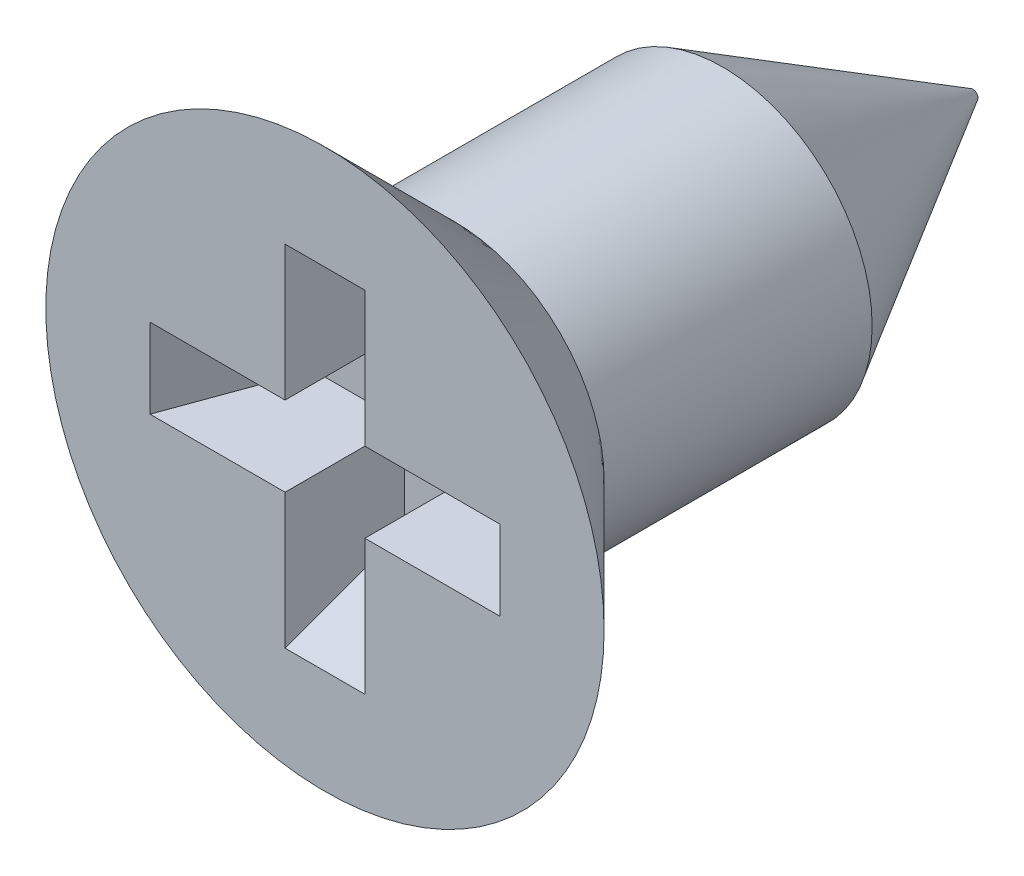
ISO-10303-21;
HEADER;
FILE_DESCRIPTION(('STEP AP214'),'2;1');
FILE_NAME('part.step','',(''),(''),'','','');
FILE_SCHEMA(('AUTOMOTIVE_DESIGN { 1 0 10303 214 1 1 1 1 }'));
ENDSEC;
DATA;
#1=APPLICATION_CONTEXT('core data for automotive mechanical design processes');
#2=APPLICATION_PROTOCOL_DEFINITION('international standard','automotive_design',2000,#1);
#3=PRODUCT_CONTEXT('',#1,'mechanical');
#4=PRODUCT('Part','Part','',(#3));
#5=PRODUCT_RELATED_PRODUCT_CATEGORY('part','',(#4));
#6=PRODUCT_DEFINITION_FORMATION('','',#4);
#7=PRODUCT_DEFINITION_CONTEXT('part definition',#1,'design');
#8=PRODUCT_DEFINITION('design','',#6,#7);
#9=PRODUCT_DEFINITION_SHAPE('','',#8);
#10=(LENGTH_UNIT() NAMED_UNIT(*) SI_UNIT(.MILLI.,.METRE.));
#11=(NAMED_UNIT(*) PLANE_ANGLE_UNIT() SI_UNIT($,.RADIAN.));
#12=(NAMED_UNIT(*) SI_UNIT($,.STERADIAN.) SOLID_ANGLE_UNIT());
#13=UNCERTAINTY_MEASURE_WITH_UNIT(LENGTH_MEASURE(1.E-05),#10,'distance_accuracy_value','');
#14=(GEOMETRIC_REPRESENTATION_CONTEXT(3) GLOBAL_UNCERTAINTY_ASSIGNED_CONTEXT((#13)) GLOBAL_UNIT_ASSIGNED_CONTEXT((#10,
#11,#12)) REPRESENTATION_CONTEXT('',''));
#15=CARTESIAN_POINT('',(0.,0.,0.));
#16=DIRECTION('',(0.,0.,1.));
#17=DIRECTION('',(1.,0.,0.));
#18=AXIS2_PLACEMENT_3D('',#15,#16,#17);
#19=CARTESIAN_POINT('',(0.4,0.4,-1.2));
#20=DIRECTION('',(0.,1.,0.));
#21=DIRECTION('',(-1.,0.,0.));
#22=AXIS2_PLACEMENT_3D('',#19,#20,#21);
#23=PLANE('',#22);
#24=DIRECTION('',(-0.34202014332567,0.,-0.939692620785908));
#25=VECTOR('',#24,1.);
#26=CARTESIAN_POINT('',(1.75499287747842,0.4,0.));
#27=LINE('',#26,#25);
#28=CARTESIAN_POINT('',(1.19429770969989,0.4,-1.54049731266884));
#29=VERTEX_POINT('',#28);
#30=CARTESIAN_POINT('',(1.31822859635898,0.4,-1.2));
#31=VERTEX_POINT('',#30);
#32=EDGE_CURVE('E313',#29,#31,#27,.F.);
#33=ORIENTED_EDGE('',*,*,#32,.T.);
#34=DIRECTION('',(-1.,0.,0.));
#35=VECTOR('',#34,1.);
#36=CARTESIAN_POINT('',(0.4,0.4,-1.2));
#37=LINE('',#36,#35);
#38=CARTESIAN_POINT('',(1.54919333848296,0.4,-1.2));
#39=VERTEX_POINT('',#38);
#40=EDGE_CURVE('E454',#39,#31,#37,.T.);
#41=ORIENTED_EDGE('',*,*,#40,.F.);
#42=CARTESIAN_POINT('',(3.05465508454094,0.4,0.280733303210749));
#43=CARTESIAN_POINT('',(2.93740544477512,0.4,0.164488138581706));
#44=CARTESIAN_POINT('',(2.82011039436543,0.4,0.0482885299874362));
#45=CARTESIAN_POINT('',(2.58535518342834,0.4,-0.183944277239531));
#46=CARTESIAN_POINT('',(2.46789502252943,0.4,-0.299977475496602));
#47=CARTESIAN_POINT('',(2.23276367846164,0.4,-0.531774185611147));
#48=CARTESIAN_POINT('',(2.11509255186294,0.4,-0.647537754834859));
#49=CARTESIAN_POINT('',(1.87936564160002,0.4,-0.878680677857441));
#50=CARTESIAN_POINT('',(1.7613098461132,0.4,-0.994060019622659));
#51=CARTESIAN_POINT('',(1.56030925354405,0.4,-1.18935151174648));
#52=CARTESIAN_POINT('',(1.47753807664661,0.4,-1.26944225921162));
#53=CARTESIAN_POINT('',(1.31147700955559,0.4,-1.42907447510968));
#54=CARTESIAN_POINT('',(1.22818715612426,0.4,-1.5086159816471));
#55=CARTESIAN_POINT('',(1.10255289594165,0.4,-1.62721046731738));
#56=CARTESIAN_POINT('',(1.06055264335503,0.4,-1.66662748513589));
#57=CARTESIAN_POINT('',(0.976229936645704,0.4,-1.74511218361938));
#58=CARTESIAN_POINT('',(0.933907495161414,0.4,-1.7841798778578));
#59=CARTESIAN_POINT('',(0.848803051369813,0.4,-1.86183524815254));
#60=CARTESIAN_POINT('',(0.806020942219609,0.4,-1.90042280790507));
#61=CARTESIAN_POINT('',(0.719742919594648,0.4,-1.97680170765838));
#62=CARTESIAN_POINT('',(0.676246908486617,0.4,-2.01459293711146));
#63=CARTESIAN_POINT('',(0.632267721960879,0.4,-2.05182724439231));
#64=B_SPLINE_CURVE_WITH_KNOTS('',3,(#42,#43,#44,#45,#46,#47,#48,#49,#50,#51,#52,#53,#54,#55,#56,
#57,#58,#59,#60,#61,#62,#63),.UNSPECIFIED.,.F.,.F.,(4,2,2,2,2,2,2,2,2,2,4),(0.,
0.495322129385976,0.990645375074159,1.48585130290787,1.98107259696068,2.32660062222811,
2.67210443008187,2.84490192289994,3.01769267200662,3.19052449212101,3.36338014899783),.UNSPECIFIED.);
#65=CARTESIAN_POINT('',(1.4456832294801,0.4,-1.3));
#66=VERTEX_POINT('',#65);
#67=EDGE_CURVE('E311',#66,#39,#64,.F.);
#68=ORIENTED_EDGE('',*,*,#67,.F.);
#69=EDGE_CURVE('E346',#29,#66,#64,.F.);
#70=ORIENTED_EDGE('',*,*,#69,.F.);
#71=EDGE_LOOP('',(#33,#41,#68,#70));
#72=FACE_BOUND('',#71,.T.);
#73=ADVANCED_FACE('F33',(#72),#23,.T.);
#74=CARTESIAN_POINT('',(0.4,-0.4,-1.2));
#75=DIRECTION('',(0.,-1.,0.));
#76=DIRECTION('',(1.,0.,0.));
#77=AXIS2_PLACEMENT_3D('',#74,#75,#76);
#78=PLANE('',#77);
#79=DIRECTION('',(1.,0.,0.));
#80=VECTOR('',#79,1.);
#81=CARTESIAN_POINT('',(0.4,-0.4,-1.2));
#82=LINE('',#81,#80);
#83=CARTESIAN_POINT('',(1.31822859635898,-0.4,-1.2));
#84=VERTEX_POINT('',#83);
#85=CARTESIAN_POINT('',(1.54919333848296,-0.4,-1.2));
#86=VERTEX_POINT('',#85);
#87=EDGE_CURVE('E450',#84,#86,#82,.T.);
#88=ORIENTED_EDGE('',*,*,#87,.F.);
#89=DIRECTION('',(-0.34202014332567,0.,-0.939692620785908));
#90=VECTOR('',#89,1.);
#91=CARTESIAN_POINT('',(1.21081625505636,-0.4,-1.49511298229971));
#92=LINE('',#91,#90);
#93=CARTESIAN_POINT('',(1.19429770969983,-0.4,-1.54049731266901));
#94=VERTEX_POINT('',#93);
#95=EDGE_CURVE('E304',#94,#84,#92,.F.);
#96=ORIENTED_EDGE('',*,*,#95,.F.);
#97=CARTESIAN_POINT('',(0.63226772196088,-0.4,-2.05182724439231));
#98=CARTESIAN_POINT('',(0.660191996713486,-0.4,-2.02821617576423));
#99=CARTESIAN_POINT('',(0.687907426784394,-0.4,-2.0043616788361));
#100=CARTESIAN_POINT('',(0.743005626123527,-0.4,-1.95627497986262));
#101=CARTESIAN_POINT('',(0.770388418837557,-0.4,-1.93204280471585));
#102=CARTESIAN_POINT('',(0.852162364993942,-0.4,-1.85894632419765));
#103=CARTESIAN_POINT('',(0.906188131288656,-0.4,-1.80967429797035));
#104=CARTESIAN_POINT('',(1.01362648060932,-0.4,-1.71049682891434));
#105=CARTESIAN_POINT('',(1.06703921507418,-0.4,-1.66059154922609));
#106=CARTESIAN_POINT('',(1.17347006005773,-0.4,-1.56035783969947));
#107=CARTESIAN_POINT('',(1.22648815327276,-0.4,-1.51002939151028));
#108=CARTESIAN_POINT('',(1.34024896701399,-0.4,-1.40145173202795));
#109=CARTESIAN_POINT('',(1.40094711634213,-0.4,-1.34315589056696));
#110=CARTESIAN_POINT('',(1.52209811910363,-0.4,-1.22630068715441));
#111=CARTESIAN_POINT('',(1.58255095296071,-0.4,-1.16774130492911));
#112=CARTESIAN_POINT('',(1.76134065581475,-0.4,-0.994030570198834));
#113=CARTESIAN_POINT('',(1.87942666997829,-0.4,-0.878621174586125));
#114=CARTESIAN_POINT('',(2.11521819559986,-0.4,-0.647414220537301));
#115=CARTESIAN_POINT('',(2.23292370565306,-0.4,-0.531616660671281));
#116=CARTESIAN_POINT('',(2.46805734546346,-0.4,-0.299817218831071));
#117=CARTESIAN_POINT('',(2.58548555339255,-0.4,-0.183815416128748));
#118=CARTESIAN_POINT('',(2.82017598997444,-0.4,0.0483535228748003));
#119=CARTESIAN_POINT('',(2.93743822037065,-0.4,0.164520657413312));
#120=CARTESIAN_POINT('',(3.05465508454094,-0.4,0.280733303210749));
#121=B_SPLINE_CURVE_WITH_KNOTS('',3,(#97,#98,#99,#100,#101,#102,#103,#104,#105,#106,#107,#108,
#109,#110,#111,#112,#113,#114,#115,#116,#117,#118,#119,#120),.UNSPECIFIED.,.F.,.F.,(4,2,2,2,2,2,
2,2,2,2,2,4),(0.,0.109700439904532,0.219393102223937,0.438742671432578,0.658036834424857,
0.877340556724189,1.12981526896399,1.38230974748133,1.87765889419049,2.3730098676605,
2.86819872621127,3.36338234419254),.UNSPECIFIED.);
#122=CARTESIAN_POINT('',(1.4456832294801,-0.4,-1.3));
#123=VERTEX_POINT('',#122);
#124=EDGE_CURVE('E410',#123,#94,#121,.F.);
#125=ORIENTED_EDGE('',*,*,#124,.F.);
#126=EDGE_CURVE('E312',#86,#123,#121,.F.);
#127=ORIENTED_EDGE('',*,*,#126,.F.);
#128=EDGE_LOOP('',(#88,#96,#125,#127));
#129=FACE_BOUND('',#128,.T.);
#130=ADVANCED_FACE('F327',(#129),#78,.T.);
#131=CARTESIAN_POINT('',(-0.4,1.75499287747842,-1.2));
#132=DIRECTION('',(-1.,0.,0.));
#133=DIRECTION('',(0.,-1.,0.));
#134=AXIS2_PLACEMENT_3D('',#131,#132,#133);
#135=PLANE('',#134);
#136=DIRECTION('',(0.,-0.34202014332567,-0.939692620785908));
#137=VECTOR('',#136,1.);
#138=CARTESIAN_POINT('',(-0.4,1.75499287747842,0.));
#139=LINE('',#138,#137);
#140=CARTESIAN_POINT('',(-0.4,1.19429770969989,-1.54049731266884));
#141=VERTEX_POINT('',#140);
#142=CARTESIAN_POINT('',(-0.4,1.31822859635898,-1.2));
#143=VERTEX_POINT('',#142);
#144=EDGE_CURVE('E298',#141,#143,#139,.F.);
#145=ORIENTED_EDGE('',*,*,#144,.T.);
#146=DIRECTION('',(0.,-1.,0.));
#147=VECTOR('',#146,1.);
#148=CARTESIAN_POINT('',(-0.4,1.75499287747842,-1.2));
#149=LINE('',#148,#147);
#150=CARTESIAN_POINT('',(-0.4,1.54919333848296,-1.2));
#151=VERTEX_POINT('',#150);
#152=EDGE_CURVE('E462',#151,#143,#149,.T.);
#153=ORIENTED_EDGE('',*,*,#152,.F.);
#154=CARTESIAN_POINT('',(-0.4,3.05465508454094,0.280733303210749));
#155=CARTESIAN_POINT('',(-0.4,2.93740544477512,0.164488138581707));
#156=CARTESIAN_POINT('',(-0.4,2.82011039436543,0.0482885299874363));
#157=CARTESIAN_POINT('',(-0.4,2.58535518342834,-0.183944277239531));
#158=CARTESIAN_POINT('',(-0.4,2.46789502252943,-0.299977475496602));
#159=CARTESIAN_POINT('',(-0.4,2.23276367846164,-0.531774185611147));
#160=CARTESIAN_POINT('',(-0.4,2.11509255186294,-0.647537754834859));
#161=CARTESIAN_POINT('',(-0.4,1.87936564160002,-0.878680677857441));
#162=CARTESIAN_POINT('',(-0.4,1.7613098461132,-0.994060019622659));
#163=CARTESIAN_POINT('',(-0.4,1.56030925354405,-1.18935151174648));
#164=CARTESIAN_POINT('',(-0.4,1.47753807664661,-1.26944225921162));
#165=CARTESIAN_POINT('',(-0.4,1.3114770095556,-1.42907447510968));
#166=CARTESIAN_POINT('',(-0.4,1.22818715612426,-1.5086159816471));
#167=CARTESIAN_POINT('',(-0.4,1.10255289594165,-1.62721046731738));
#168=CARTESIAN_POINT('',(-0.4,1.06055264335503,-1.66662748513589));
#169=CARTESIAN_POINT('',(-0.4,0.976229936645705,-1.74511218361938));
#170=CARTESIAN_POINT('',(-0.4,0.933907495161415,-1.7841798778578));
#171=CARTESIAN_POINT('',(-0.4,0.848803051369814,-1.86183524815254));
#172=CARTESIAN_POINT('',(-0.4,0.80602094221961,-1.90042280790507));
#173=CARTESIAN_POINT('',(-0.4,0.719742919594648,-1.97680170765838));
#174=CARTESIAN_POINT('',(-0.4,0.676246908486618,-2.01459293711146));
#175=CARTESIAN_POINT('',(-0.4,0.63226772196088,-2.05182724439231));
#176=B_SPLINE_CURVE_WITH_KNOTS('',3,(#154,#155,#156,#157,#158,#159,#160,#161,#162,#163,#164,
#165,#166,#167,#168,#169,#170,#171,#172,#173,#174,#175),.UNSPECIFIED.,.F.,.F.,(4,2,2,2,2,2,2,2,
2,2,4),(0.,0.495322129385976,0.990645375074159,1.48585130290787,1.98107259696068,
2.32660062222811,2.67210443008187,2.84490192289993,3.01769267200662,3.19052449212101,
3.36338014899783),.UNSPECIFIED.);
#177=CARTESIAN_POINT('',(-0.4,1.4456832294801,-1.3));
#178=VERTEX_POINT('',#177);
#179=EDGE_CURVE('E296',#178,#151,#176,.F.);
#180=ORIENTED_EDGE('',*,*,#179,.F.);
#181=EDGE_CURVE('E362',#141,#178,#176,.F.);
#182=ORIENTED_EDGE('',*,*,#181,.F.);
#183=EDGE_LOOP('',(#145,#153,#180,#182));
#184=FACE_BOUND('',#183,.T.);
#185=ADVANCED_FACE('F337',(#184),#135,.T.);
#186=CARTESIAN_POINT('',(0.4,1.75499287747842,-1.2));
#187=DIRECTION('',(1.,0.,0.));
#188=DIRECTION('',(0.,0.,-1.));
#189=AXIS2_PLACEMENT_3D('',#186,#187,#188);
#190=PLANE('',#189);
#191=DIRECTION('',(0.,1.,0.));
#192=VECTOR('',#191,1.);
#193=CARTESIAN_POINT('',(0.4,1.75499287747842,-1.2));
#194=LINE('',#193,#192);
#195=CARTESIAN_POINT('',(0.4,1.31822859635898,-1.2));
#196=VERTEX_POINT('',#195);
#197=CARTESIAN_POINT('',(0.4,1.54919333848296,-1.2));
#198=VERTEX_POINT('',#197);
#199=EDGE_CURVE('E459',#196,#198,#194,.T.);
#200=ORIENTED_EDGE('',*,*,#199,.F.);
#201=DIRECTION('',(0.,-0.34202014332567,-0.939692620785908));
#202=VECTOR('',#201,1.);
#203=CARTESIAN_POINT('',(0.4,1.3693203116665,-1.05962666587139));
#204=LINE('',#203,#202);
#205=CARTESIAN_POINT('',(0.4,1.19429770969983,-1.54049731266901));
#206=VERTEX_POINT('',#205);
#207=EDGE_CURVE('E289',#206,#196,#204,.F.);
#208=ORIENTED_EDGE('',*,*,#207,.F.);
#209=CARTESIAN_POINT('',(0.4,0.632267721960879,-2.05182724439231));
#210=CARTESIAN_POINT('',(0.4,0.660191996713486,-2.02821617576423));
#211=CARTESIAN_POINT('',(0.4,0.687907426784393,-2.00436167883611));
#212=CARTESIAN_POINT('',(0.4,0.743005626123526,-1.95627497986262));
#213=CARTESIAN_POINT('',(0.4,0.770388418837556,-1.93204280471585));
#214=CARTESIAN_POINT('',(0.4,0.852162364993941,-1.85894632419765));
#215=CARTESIAN_POINT('',(0.4,0.906188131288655,-1.80967429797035));
#216=CARTESIAN_POINT('',(0.4,1.01362648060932,-1.71049682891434));
#217=CARTESIAN_POINT('',(0.4,1.06703921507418,-1.66059154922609));
#218=CARTESIAN_POINT('',(0.4,1.17347006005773,-1.56035783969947));
#219=CARTESIAN_POINT('',(0.4,1.22648815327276,-1.51002939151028));
#220=CARTESIAN_POINT('',(0.4,1.34024896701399,-1.40145173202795));
#221=CARTESIAN_POINT('',(0.4,1.40094711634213,-1.34315589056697));
#222=CARTESIAN_POINT('',(0.4,1.52209811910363,-1.22630068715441));
#223=CARTESIAN_POINT('',(0.4,1.58255095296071,-1.16774130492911));
#224=CARTESIAN_POINT('',(0.4,1.76134065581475,-0.994030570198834));
#225=CARTESIAN_POINT('',(0.4,1.87942666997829,-0.878621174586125));
#226=CARTESIAN_POINT('',(0.4,2.11521819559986,-0.647414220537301));
#227=CARTESIAN_POINT('',(0.4,2.23292370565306,-0.53161666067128));
#228=CARTESIAN_POINT('',(0.4,2.46805734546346,-0.299817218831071));
#229=CARTESIAN_POINT('',(0.4,2.58548555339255,-0.183815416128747));
#230=CARTESIAN_POINT('',(0.4,2.82017598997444,0.0483535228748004));
#231=CARTESIAN_POINT('',(0.4,2.93743822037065,0.164520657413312));
#232=CARTESIAN_POINT('',(0.4,3.05465508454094,0.280733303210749));
#233=B_SPLINE_CURVE_WITH_KNOTS('',3,(#209,#210,#211,#212,#213,#214,#215,#216,#217,#218,#219,
#220,#221,#222,#223,#224,#225,#226,#227,#228,#229,#230,#231,#232),.UNSPECIFIED.,.F.,.F.,(4,2,2,
2,2,2,2,2,2,2,2,4),(0.,0.109700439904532,0.219393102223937,0.438742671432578,0.658036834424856,
0.877340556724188,1.12981526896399,1.38230974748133,1.8776588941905,2.3730098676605,
2.86819872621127,3.36338234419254),.UNSPECIFIED.);
#234=CARTESIAN_POINT('',(0.4,1.4456832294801,-1.3));
#235=VERTEX_POINT('',#234);
#236=EDGE_CURVE('E352',#235,#206,#233,.F.);
#237=ORIENTED_EDGE('',*,*,#236,.F.);
#238=EDGE_CURVE('E297',#198,#235,#233,.F.);
#239=ORIENTED_EDGE('',*,*,#238,.F.);
#240=EDGE_LOOP('',(#200,#208,#237,#239));
#241=FACE_BOUND('',#240,.T.);
#242=ADVANCED_FACE('F423',(#241),#190,.T.);
#243=CARTESIAN_POINT('',(0.4,-0.4,-1.2));
#244=DIRECTION('',(1.,0.,0.));
#245=DIRECTION('',(0.,1.,0.));
#246=AXIS2_PLACEMENT_3D('',#243,#244,#245);
#247=PLANE('',#246);
#248=DIRECTION('',(0.,0.34202014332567,-0.939692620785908));
#249=VECTOR('',#248,1.);
#250=CARTESIAN_POINT('',(0.4,-1.75499287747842,0.));
#251=LINE('',#250,#249);
#252=CARTESIAN_POINT('',(0.4,-1.19429770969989,-1.54049731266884));
#253=VERTEX_POINT('',#252);
#254=CARTESIAN_POINT('',(0.4,-1.31822859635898,-1.2));
#255=VERTEX_POINT('',#254);
#256=EDGE_CURVE('E283',#253,#255,#251,.F.);
#257=ORIENTED_EDGE('',*,*,#256,.T.);
#258=DIRECTION('',(0.,1.,0.));
#259=VECTOR('',#258,1.);
#260=CARTESIAN_POINT('',(0.4,-0.4,-1.2));
#261=LINE('',#260,#259);
#262=CARTESIAN_POINT('',(0.4,-1.54919333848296,-1.2));
#263=VERTEX_POINT('',#262);
#264=EDGE_CURVE('E436',#263,#255,#261,.T.);
#265=ORIENTED_EDGE('',*,*,#264,.F.);
#266=CARTESIAN_POINT('',(0.4,-3.05465508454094,0.280733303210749));
#267=CARTESIAN_POINT('',(0.4,-2.93740544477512,0.164488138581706));
#268=CARTESIAN_POINT('',(0.4,-2.82011039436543,0.0482885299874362));
#269=CARTESIAN_POINT('',(0.4,-2.58535518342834,-0.183944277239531));
#270=CARTESIAN_POINT('',(0.4,-2.46789502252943,-0.299977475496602));
#271=CARTESIAN_POINT('',(0.4,-2.23276367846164,-0.531774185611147));
#272=CARTESIAN_POINT('',(0.4,-2.11509255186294,-0.647537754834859));
#273=CARTESIAN_POINT('',(0.4,-1.87936564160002,-0.878680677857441));
#274=CARTESIAN_POINT('',(0.4,-1.7613098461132,-0.994060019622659));
#275=CARTESIAN_POINT('',(0.4,-1.56030925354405,-1.18935151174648));
#276=CARTESIAN_POINT('',(0.4,-1.47753807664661,-1.26944225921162));
#277=CARTESIAN_POINT('',(0.4,-1.31147700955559,-1.42907447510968));
#278=CARTESIAN_POINT('',(0.4,-1.22818715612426,-1.5086159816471));
#279=CARTESIAN_POINT('',(0.4,-1.10255289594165,-1.62721046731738));
#280=CARTESIAN_POINT('',(0.4,-1.06055264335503,-1.66662748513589));
#281=CARTESIAN_POINT('',(0.4,-0.976229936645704,-1.74511218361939));
#282=CARTESIAN_POINT('',(0.4,-0.933907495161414,-1.7841798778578));
#283=CARTESIAN_POINT('',(0.4,-0.848803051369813,-1.86183524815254));
#284=CARTESIAN_POINT('',(0.4,-0.806020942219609,-1.90042280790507));
#285=CARTESIAN_POINT('',(0.4,-0.719742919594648,-1.97680170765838));
#286=CARTESIAN_POINT('',(0.4,-0.676246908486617,-2.01459293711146));
#287=CARTESIAN_POINT('',(0.4,-0.632267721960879,-2.05182724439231));
#288=B_SPLINE_CURVE_WITH_KNOTS('',3,(#266,#267,#268,#269,#270,#271,#272,#273,#274,#275,#276,
#277,#278,#279,#280,#281,#282,#283,#284,#285,#286,#287),.UNSPECIFIED.,.F.,.F.,(4,2,2,2,2,2,2,2,
2,2,4),(0.,0.495322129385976,0.990645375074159,1.48585130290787,1.98107259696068,
2.32660062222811,2.67210443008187,2.84490192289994,3.01769267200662,3.19052449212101,
3.36338014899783),.UNSPECIFIED.);
#289=CARTESIAN_POINT('',(0.4,-1.4456832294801,-1.3));
#290=VERTEX_POINT('',#289);
#291=EDGE_CURVE('E281',#290,#263,#288,.F.);
#292=ORIENTED_EDGE('',*,*,#291,.F.);
#293=EDGE_CURVE('E405',#253,#290,#288,.F.);
#294=ORIENTED_EDGE('',*,*,#293,.F.);
#295=EDGE_LOOP('',(#257,#265,#292,#294));
#296=FACE_BOUND('',#295,.T.);
#297=ADVANCED_FACE('F417',(#296),#247,.T.);
#298=CARTESIAN_POINT('',(-0.4,-0.4,-1.2));
#299=DIRECTION('',(-1.,0.,0.));
#300=DIRECTION('',(0.,-1.,0.));
#301=AXIS2_PLACEMENT_3D('',#298,#299,#300);
#302=PLANE('',#301);
#303=DIRECTION('',(0.,-1.,0.));
#304=VECTOR('',#303,1.);
#305=CARTESIAN_POINT('',(-0.4,-0.4,-1.2));
#306=LINE('',#305,#304);
#307=CARTESIAN_POINT('',(-0.4,-1.31822859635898,-1.2));
#308=VERTEX_POINT('',#307);
#309=CARTESIAN_POINT('',(-0.4,-1.54919333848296,-1.2));
#310=VERTEX_POINT('',#309);
#311=EDGE_CURVE('E207',#308,#310,#306,.T.);
#312=ORIENTED_EDGE('',*,*,#311,.F.);
#313=DIRECTION('',(0.,0.34202014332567,-0.939692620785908));
#314=VECTOR('',#313,1.);
#315=CARTESIAN_POINT('',(-0.4,-1.21081625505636,-1.49511298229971));
#316=LINE('',#315,#314);
#317=CARTESIAN_POINT('',(-0.4,-1.19429770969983,-1.54049731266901));
#318=VERTEX_POINT('',#317);
#319=EDGE_CURVE('E222',#318,#308,#316,.F.);
#320=ORIENTED_EDGE('',*,*,#319,.F.);
#321=CARTESIAN_POINT('',(-0.4,-0.632267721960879,-2.05182724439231));
#322=CARTESIAN_POINT('',(-0.4,-0.660191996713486,-2.02821617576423));
#323=CARTESIAN_POINT('',(-0.4,-0.687907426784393,-2.00436167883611));
#324=CARTESIAN_POINT('',(-0.4,-0.743005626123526,-1.95627497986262));
#325=CARTESIAN_POINT('',(-0.4,-0.770388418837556,-1.93204280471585));
#326=CARTESIAN_POINT('',(-0.4,-0.852162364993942,-1.85894632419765));
#327=CARTESIAN_POINT('',(-0.4,-0.906188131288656,-1.80967429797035));
#328=CARTESIAN_POINT('',(-0.4,-1.01362648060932,-1.71049682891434));
#329=CARTESIAN_POINT('',(-0.4,-1.06703921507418,-1.66059154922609));
#330=CARTESIAN_POINT('',(-0.4,-1.17347006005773,-1.56035783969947));
#331=CARTESIAN_POINT('',(-0.4,-1.22648815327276,-1.51002939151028));
#332=CARTESIAN_POINT('',(-0.4,-1.34024896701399,-1.40145173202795));
#333=CARTESIAN_POINT('',(-0.4,-1.40094711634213,-1.34315589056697));
#334=CARTESIAN_POINT('',(-0.4,-1.52209811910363,-1.22630068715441));
#335=CARTESIAN_POINT('',(-0.4,-1.58255095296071,-1.16774130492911));
#336=CARTESIAN_POINT('',(-0.4,-1.76134065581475,-0.994030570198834));
#337=CARTESIAN_POINT('',(-0.4,-1.87942666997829,-0.878621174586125));
#338=CARTESIAN_POINT('',(-0.4,-2.11521819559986,-0.647414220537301));
#339=CARTESIAN_POINT('',(-0.4,-2.23292370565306,-0.53161666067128));
#340=CARTESIAN_POINT('',(-0.4,-2.46805734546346,-0.29981721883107));
#341=CARTESIAN_POINT('',(-0.4,-2.58548555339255,-0.183815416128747));
#342=CARTESIAN_POINT('',(-0.4,-2.82017598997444,0.0483535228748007));
#343=CARTESIAN_POINT('',(-0.4,-2.93743822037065,0.164520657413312));
#344=CARTESIAN_POINT('',(-0.4,-3.05465508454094,0.280733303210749));
#345=B_SPLINE_CURVE_WITH_KNOTS('',3,(#321,#322,#323,#324,#325,#326,#327,#328,#329,#330,#331,
#332,#333,#334,#335,#336,#337,#338,#339,#340,#341,#342,#343,#344),.UNSPECIFIED.,.F.,.F.,(4,2,2,
2,2,2,2,2,2,2,2,4),(0.,0.109700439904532,0.219393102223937,0.438742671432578,0.658036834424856,
0.877340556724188,1.12981526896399,1.38230974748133,1.8776588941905,2.3730098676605,
2.86819872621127,3.36338234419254),.UNSPECIFIED.);
#346=CARTESIAN_POINT('',(-0.4,-1.4456832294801,-1.3));
#347=VERTEX_POINT('',#346);
#348=EDGE_CURVE('E253',#347,#318,#345,.F.);
#349=ORIENTED_EDGE('',*,*,#348,.F.);
#350=EDGE_CURVE('E282',#310,#347,#345,.F.);
#351=ORIENTED_EDGE('',*,*,#350,.F.);
#352=EDGE_LOOP('',(#312,#320,#349,#351));
#353=FACE_BOUND('',#352,.T.);
#354=ADVANCED_FACE('F422',(#353),#302,.T.);
#355=CARTESIAN_POINT('',(-1.75499287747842,-0.4,-1.2));
#356=DIRECTION('',(0.,-1.,0.));
#357=DIRECTION('',(1.,0.,0.));
#358=AXIS2_PLACEMENT_3D('',#355,#356,#357);
#359=PLANE('',#358);
#360=DIRECTION('',(0.34202014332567,0.,-0.939692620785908));
#361=VECTOR('',#360,1.);
#362=CARTESIAN_POINT('',(-1.75499287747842,-0.4,0.));
#363=LINE('',#362,#361);
#364=CARTESIAN_POINT('',(-1.19429770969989,-0.4,-1.54049731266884));
#365=VERTEX_POINT('',#364);
#366=CARTESIAN_POINT('',(-1.31822859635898,-0.4,-1.2));
#367=VERTEX_POINT('',#366);
#368=EDGE_CURVE('E223',#365,#367,#363,.F.);
#369=ORIENTED_EDGE('',*,*,#368,.T.);
#370=DIRECTION('',(1.,0.,0.));
#371=VECTOR('',#370,1.);
#372=CARTESIAN_POINT('',(-1.75499287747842,-0.4,-1.2));
#373=LINE('',#372,#371);
#374=CARTESIAN_POINT('',(-1.54919333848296,-0.4,-1.2));
#375=VERTEX_POINT('',#374);
#376=EDGE_CURVE('E215',#375,#367,#373,.T.);
#377=ORIENTED_EDGE('',*,*,#376,.F.);
#378=CARTESIAN_POINT('',(-3.05465508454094,-0.4,0.280733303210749));
#379=CARTESIAN_POINT('',(-2.93740544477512,-0.4,0.164488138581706));
#380=CARTESIAN_POINT('',(-2.82011039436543,-0.4,0.0482885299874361));
#381=CARTESIAN_POINT('',(-2.58535518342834,-0.4,-0.183944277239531));
#382=CARTESIAN_POINT('',(-2.46789502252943,-0.4,-0.299977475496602));
#383=CARTESIAN_POINT('',(-2.23276367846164,-0.4,-0.531774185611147));
#384=CARTESIAN_POINT('',(-2.11509255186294,-0.4,-0.647537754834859));
#385=CARTESIAN_POINT('',(-1.87936564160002,-0.4,-0.878680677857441));
#386=CARTESIAN_POINT('',(-1.7613098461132,-0.4,-0.994060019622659));
#387=CARTESIAN_POINT('',(-1.56030925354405,-0.4,-1.18935151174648));
#388=CARTESIAN_POINT('',(-1.47753807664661,-0.4,-1.26944225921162));
#389=CARTESIAN_POINT('',(-1.3114770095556,-0.4,-1.42907447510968));
#390=CARTESIAN_POINT('',(-1.22818715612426,-0.4,-1.5086159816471));
#391=CARTESIAN_POINT('',(-1.10255289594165,-0.4,-1.62721046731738));
#392=CARTESIAN_POINT('',(-1.06055264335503,-0.4,-1.66662748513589));
#393=CARTESIAN_POINT('',(-0.976229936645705,-0.4,-1.74511218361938));
#394=CARTESIAN_POINT('',(-0.933907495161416,-0.4,-1.78417987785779));
#395=CARTESIAN_POINT('',(-0.848803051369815,-0.4,-1.86183524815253));
#396=CARTESIAN_POINT('',(-0.806020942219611,-0.4,-1.90042280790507));
#397=CARTESIAN_POINT('',(-0.719742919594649,-0.4,-1.97680170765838));
#398=CARTESIAN_POINT('',(-0.676246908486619,-0.4,-2.01459293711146));
#399=CARTESIAN_POINT('',(-0.632267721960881,-0.4,-2.05182724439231));
#400=B_SPLINE_CURVE_WITH_KNOTS('',3,(#378,#379,#380,#381,#382,#383,#384,#385,#386,#387,#388,
#389,#390,#391,#392,#393,#394,#395,#396,#397,#398,#399),.UNSPECIFIED.,.F.,.F.,(4,2,2,2,2,2,2,2,
2,2,4),(0.,0.495322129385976,0.990645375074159,1.48585130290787,1.98107259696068,
2.32660062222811,2.67210443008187,2.84490192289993,3.01769267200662,3.19052449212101,
3.36338014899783),.UNSPECIFIED.);
#401=CARTESIAN_POINT('',(-1.4456832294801,-0.4,-1.3));
#402=VERTEX_POINT('',#401);
#403=EDGE_CURVE('E48',#402,#375,#400,.F.);
#404=ORIENTED_EDGE('',*,*,#403,.F.);
#405=EDGE_CURVE('E389',#365,#402,#400,.F.);
#406=ORIENTED_EDGE('',*,*,#405,.F.);
#407=EDGE_LOOP('',(#369,#377,#404,#406));
#408=FACE_BOUND('',#407,.T.);
#409=ADVANCED_FACE('F386',(#408),#359,.T.);
#410=CARTESIAN_POINT('',(0.,0.,-1.3));
#411=DIRECTION('',(0.,0.,1.));
#412=DIRECTION('',(1.,0.,0.));
#413=AXIS2_PLACEMENT_3D('',#410,#411,#412);
#414=CONICAL_SURFACE('',#413,1.5,0.78539816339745);
#415=CARTESIAN_POINT('',(-0.632267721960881,0.4,-2.05182724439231));
#416=CARTESIAN_POINT('',(-0.660191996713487,0.4,-2.02821617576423));
#417=CARTESIAN_POINT('',(-0.687907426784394,0.4,-2.0043616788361));
#418=CARTESIAN_POINT('',(-0.743005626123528,0.4,-1.95627497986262));
#419=CARTESIAN_POINT('',(-0.770388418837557,0.4,-1.93204280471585));
#420=CARTESIAN_POINT('',(-0.852162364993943,0.4,-1.85894632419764));
#421=CARTESIAN_POINT('',(-0.906188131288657,0.4,-1.80967429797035));
#422=CARTESIAN_POINT('',(-1.01362648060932,0.4,-1.71049682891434));
#423=CARTESIAN_POINT('',(-1.06703921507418,0.4,-1.66059154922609));
#424=CARTESIAN_POINT('',(-1.17347006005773,0.4,-1.56035783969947));
#425=CARTESIAN_POINT('',(-1.22648815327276,0.4,-1.51002939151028));
#426=CARTESIAN_POINT('',(-1.34024896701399,0.4,-1.40145173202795));
#427=CARTESIAN_POINT('',(-1.40094711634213,0.4,-1.34315589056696));
#428=CARTESIAN_POINT('',(-1.52209811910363,0.4,-1.22630068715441));
#429=CARTESIAN_POINT('',(-1.58255095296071,0.4,-1.16774130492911));
#430=CARTESIAN_POINT('',(-1.76134065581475,0.4,-0.994030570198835));
#431=CARTESIAN_POINT('',(-1.87942666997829,0.4,-0.878621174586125));
#432=CARTESIAN_POINT('',(-2.11521819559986,0.4,-0.647414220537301));
#433=CARTESIAN_POINT('',(-2.23292370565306,0.4,-0.53161666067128));
#434=CARTESIAN_POINT('',(-2.46805734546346,0.4,-0.299817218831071));
#435=CARTESIAN_POINT('',(-2.58548555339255,0.4,-0.183815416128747));
#436=CARTESIAN_POINT('',(-2.82017598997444,0.4,0.0483535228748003));
#437=CARTESIAN_POINT('',(-2.93743822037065,0.4,0.164520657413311));
#438=CARTESIAN_POINT('',(-3.05465508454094,0.4,0.280733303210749));
#439=B_SPLINE_CURVE_WITH_KNOTS('',3,(#415,#416,#417,#418,#419,#420,#421,#422,#423,#424,#425,
#426,#427,#428,#429,#430,#431,#432,#433,#434,#435,#436,#437,#438),.UNSPECIFIED.,.F.,.F.,(4,2,2,
2,2,2,2,2,2,2,2,4),(0.,0.109700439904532,0.219393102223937,0.438742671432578,0.658036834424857,
0.877340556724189,1.12981526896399,1.38230974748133,1.87765889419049,2.3730098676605,
2.86819872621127,3.36338234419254),.UNSPECIFIED.);
#440=CARTESIAN_POINT('',(-1.54919333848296,0.4,-1.2));
#441=VERTEX_POINT('',#440);
#442=CARTESIAN_POINT('',(-1.4456832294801,0.4,-1.3));
#443=VERTEX_POINT('',#442);
#444=EDGE_CURVE('E56',#441,#443,#439,.F.);
#445=ORIENTED_EDGE('',*,*,#444,.T.);
#446=CARTESIAN_POINT('',(0.,0.,-1.3));
#447=DIRECTION('',(0.,0.,1.));
#448=DIRECTION('',(1.,0.,0.));
#449=AXIS2_PLACEMENT_3D('',#446,#447,#448);
#450=CIRCLE('',#449,1.5);
#451=EDGE_CURVE('E237',#443,#402,#450,.T.);
#452=ORIENTED_EDGE('',*,*,#451,.T.);
#453=ORIENTED_EDGE('',*,*,#403,.T.);
#454=CARTESIAN_POINT('',(0.,0.,-1.2));
#455=DIRECTION('',(0.,0.,-1.));
#456=DIRECTION('',(-1.,0.,0.));
#457=AXIS2_PLACEMENT_3D('',#454,#455,#456);
#458=CIRCLE('',#457,1.6);
#459=EDGE_CURVE('E240',#375,#441,#458,.T.);
#460=ORIENTED_EDGE('',*,*,#459,.T.);
#461=EDGE_LOOP('',(#445,#452,#453,#460));
#462=FACE_BOUND('',#461,.T.);
#463=ADVANCED_FACE('F592',(#462),#414,.T.);
#464=EDGE_CURVE('E543',#347,#290,#450,.T.);
#465=ORIENTED_EDGE('',*,*,#464,.T.);
#466=ORIENTED_EDGE('',*,*,#291,.T.);
#467=CARTESIAN_POINT('',(0.,0.,-1.2));
#468=DIRECTION('',(0.,0.,-1.));
#469=DIRECTION('',(-1.,0.,0.));
#470=AXIS2_PLACEMENT_3D('',#467,#468,#469);
#471=CIRCLE('',#470,1.6);
#472=EDGE_CURVE('E357',#263,#310,#471,.T.);
#473=ORIENTED_EDGE('',*,*,#472,.T.);
#474=ORIENTED_EDGE('',*,*,#350,.T.);
#475=EDGE_LOOP('',(#465,#466,#473,#474));
#476=FACE_BOUND('',#475,.T.);
#477=ADVANCED_FACE('F555',(#476),#414,.T.);
#478=EDGE_CURVE('E540',#123,#66,#450,.T.);
#479=ORIENTED_EDGE('',*,*,#478,.T.);
#480=ORIENTED_EDGE('',*,*,#67,.T.);
#481=CARTESIAN_POINT('',(0.,0.,-1.2));
#482=DIRECTION('',(0.,0.,-1.));
#483=DIRECTION('',(-1.,0.,0.));
#484=AXIS2_PLACEMENT_3D('',#481,#482,#483);
#485=CIRCLE('',#484,1.6);
#486=EDGE_CURVE('E361',#39,#86,#485,.T.);
#487=ORIENTED_EDGE('',*,*,#486,.T.);
#488=ORIENTED_EDGE('',*,*,#126,.T.);
#489=EDGE_LOOP('',(#479,#480,#487,#488));
#490=FACE_BOUND('',#489,.T.);
#491=ADVANCED_FACE('F545',(#490),#414,.T.);
#492=EDGE_CURVE('E232',#235,#178,#450,.T.);
#493=ORIENTED_EDGE('',*,*,#492,.T.);
#494=ORIENTED_EDGE('',*,*,#179,.T.);
#495=CARTESIAN_POINT('',(0.,0.,-1.2));
#496=DIRECTION('',(0.,0.,-1.));
#497=DIRECTION('',(-1.,0.,0.));
#498=AXIS2_PLACEMENT_3D('',#495,#496,#497);
#499=CIRCLE('',#498,1.6);
#500=EDGE_CURVE('E359',#151,#198,#499,.T.);
#501=ORIENTED_EDGE('',*,*,#500,.T.);
#502=ORIENTED_EDGE('',*,*,#238,.T.);
#503=EDGE_LOOP('',(#493,#494,#501,#502));
#504=FACE_BOUND('',#503,.T.);
#505=ADVANCED_FACE('F531',(#504),#414,.T.);
#506=CARTESIAN_POINT('',(-1.75499287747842,0.4,-1.2));
#507=DIRECTION('',(0.,1.,0.));
#508=DIRECTION('',(-1.,0.,0.));
#509=AXIS2_PLACEMENT_3D('',#506,#507,#508);
#510=PLANE('',#509);
#511=DIRECTION('',(-1.,0.,0.));
#512=VECTOR('',#511,1.);
#513=CARTESIAN_POINT('',(-1.75499287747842,0.4,-1.2));
#514=LINE('',#513,#512);
#515=CARTESIAN_POINT('',(-1.31822859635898,0.4,-1.2));
#516=VERTEX_POINT('',#515);
#517=EDGE_CURVE('E467',#516,#441,#514,.T.);
#518=ORIENTED_EDGE('',*,*,#517,.F.);
#519=DIRECTION('',(0.34202014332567,0.,-0.939692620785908));
#520=VECTOR('',#519,1.);
#521=CARTESIAN_POINT('',(-1.3693203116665,0.4,-1.05962666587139));
#522=LINE('',#521,#520);
#523=CARTESIAN_POINT('',(-1.19429770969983,0.4,-1.54049731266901));
#524=VERTEX_POINT('',#523);
#525=EDGE_CURVE('E245',#524,#516,#522,.F.);
#526=ORIENTED_EDGE('',*,*,#525,.F.);
#527=EDGE_CURVE('E395',#443,#524,#439,.F.);
#528=ORIENTED_EDGE('',*,*,#527,.F.);
#529=ORIENTED_EDGE('',*,*,#444,.F.);
#530=EDGE_LOOP('',(#518,#526,#528,#529));
#531=FACE_BOUND('',#530,.T.);
#532=ADVANCED_FACE('F584',(#531),#510,.T.);
#533=CARTESIAN_POINT('',(0.,2.8,0.));
#534=DIRECTION('',(0.,0.,-1.));
#535=DIRECTION('',(-1.,0.,0.));
#536=AXIS2_PLACEMENT_3D('',#533,#534,#535);
#537=PLANE('',#536);
#538=DIRECTION('',(1.,0.,0.));
#539=VECTOR('',#538,1.);
#540=CARTESIAN_POINT('',(-1.75499287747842,-0.4,0.));
#541=LINE('',#540,#539);
#542=CARTESIAN_POINT('',(-1.75499287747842,-0.4,0.));
#543=VERTEX_POINT('',#542);
#544=CARTESIAN_POINT('',(-0.4,-0.4,0.));
#545=VERTEX_POINT('',#544);
#546=EDGE_CURVE('E220',#543,#545,#541,.T.);
#547=ORIENTED_EDGE('',*,*,#546,.F.);
#548=DIRECTION('',(0.,-1.,0.));
#549=VECTOR('',#548,1.);
#550=CARTESIAN_POINT('',(-1.75499287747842,-0.4,0.));
#551=LINE('',#550,#549);
#552=CARTESIAN_POINT('',(-1.75499287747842,0.4,0.));
#553=VERTEX_POINT('',#552);
#554=EDGE_CURVE('E469',#553,#543,#551,.T.);
#555=ORIENTED_EDGE('',*,*,#554,.F.);
#556=DIRECTION('',(-1.,0.,0.));
#557=VECTOR('',#556,1.);
#558=CARTESIAN_POINT('',(-1.75499287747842,0.4,0.));
#559=LINE('',#558,#557);
#560=CARTESIAN_POINT('',(-0.4,0.4,0.));
#561=VERTEX_POINT('',#560);
#562=EDGE_CURVE('E496',#561,#553,#559,.T.);
#563=ORIENTED_EDGE('',*,*,#562,.F.);
#564=DIRECTION('',(0.,-1.,0.));
#565=VECTOR('',#564,1.);
#566=CARTESIAN_POINT('',(-0.4,1.75499287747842,0.));
#567=LINE('',#566,#565);
#568=CARTESIAN_POINT('',(-0.4,1.75499287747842,0.));
#569=VERTEX_POINT('',#568);
#570=EDGE_CURVE('E493',#569,#561,#567,.T.);
#571=ORIENTED_EDGE('',*,*,#570,.F.);
#572=DIRECTION('',(-1.,0.,0.));
#573=VECTOR('',#572,1.);
#574=CARTESIAN_POINT('',(-0.4,1.75499287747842,0.));
#575=LINE('',#574,#573);
#576=CARTESIAN_POINT('',(0.4,1.75499287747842,0.));
#577=VERTEX_POINT('',#576);
#578=EDGE_CURVE('E490',#577,#569,#575,.T.);
#579=ORIENTED_EDGE('',*,*,#578,.F.);
#580=DIRECTION('',(0.,1.,0.));
#581=VECTOR('',#580,1.);
#582=CARTESIAN_POINT('',(0.4,1.75499287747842,0.));
#583=LINE('',#582,#581);
#584=CARTESIAN_POINT('',(0.4,0.4,0.));
#585=VERTEX_POINT('',#584);
#586=EDGE_CURVE('E487',#585,#577,#583,.T.);
#587=ORIENTED_EDGE('',*,*,#586,.F.);
#588=DIRECTION('',(-1.,0.,0.));
#589=VECTOR('',#588,1.);
#590=CARTESIAN_POINT('',(0.4,0.4,0.));
#591=LINE('',#590,#589);
#592=CARTESIAN_POINT('',(1.75499287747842,0.4,0.));
#593=VERTEX_POINT('',#592);
#594=EDGE_CURVE('E484',#593,#585,#591,.T.);
#595=ORIENTED_EDGE('',*,*,#594,.F.);
#596=DIRECTION('',(0.,1.,0.));
#597=VECTOR('',#596,1.);
#598=CARTESIAN_POINT('',(1.75499287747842,0.4,0.));
#599=LINE('',#598,#597);
#600=CARTESIAN_POINT('',(1.75499287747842,-0.4,0.));
#601=VERTEX_POINT('',#600);
#602=EDGE_CURVE('E481',#601,#593,#599,.T.);
#603=ORIENTED_EDGE('',*,*,#602,.F.);
#604=DIRECTION('',(1.,0.,0.));
#605=VECTOR('',#604,1.);
#606=CARTESIAN_POINT('',(0.4,-0.4,0.));
#607=LINE('',#606,#605);
#608=CARTESIAN_POINT('',(0.4,-0.4,0.));
#609=VERTEX_POINT('',#608);
#610=EDGE_CURVE('E478',#609,#601,#607,.T.);
#611=ORIENTED_EDGE('',*,*,#610,.F.);
#612=DIRECTION('',(0.,1.,0.));
#613=VECTOR('',#612,1.);
#614=CARTESIAN_POINT('',(0.4,-0.4,0.));
#615=LINE('',#614,#613);
#616=CARTESIAN_POINT('',(0.4,-1.75499287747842,0.));
#617=VERTEX_POINT('',#616);
#618=EDGE_CURVE('E476',#617,#609,#615,.T.);
#619=ORIENTED_EDGE('',*,*,#618,.F.);
#620=DIRECTION('',(1.,0.,0.));
#621=VECTOR('',#620,1.);
#622=CARTESIAN_POINT('',(0.4,-1.75499287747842,0.));
#623=LINE('',#622,#621);
#624=CARTESIAN_POINT('',(-0.4,-1.75499287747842,0.));
#625=VERTEX_POINT('',#624);
#626=EDGE_CURVE('E440',#625,#617,#623,.T.);
#627=ORIENTED_EDGE('',*,*,#626,.F.);
#628=DIRECTION('',(0.,-1.,0.));
#629=VECTOR('',#628,1.);
#630=CARTESIAN_POINT('',(-0.4,-0.4,0.));
#631=LINE('',#630,#629);
#632=EDGE_CURVE('E473',#545,#625,#631,.T.);
#633=ORIENTED_EDGE('',*,*,#632,.F.);
#634=EDGE_LOOP('',(#547,#555,#563,#571,#579,#587,#595,#603,#611,#619,#627,#633));
#635=FACE_BOUND('',#634,.T.);
#636=CARTESIAN_POINT('',(0.,0.,0.));
#637=DIRECTION('',(0.,0.,1.));
#638=DIRECTION('',(1.,0.,0.));
#639=AXIS2_PLACEMENT_3D('',#636,#637,#638);
#640=CIRCLE('',#639,2.8);
#641=CARTESIAN_POINT('',(2.8,0.,0.));
#642=VERTEX_POINT('',#641);
#643=EDGE_CURVE('E235',#642,#642,#640,.T.);
#644=ORIENTED_EDGE('',*,*,#643,.T.);
#645=EDGE_LOOP('',(#644));
#646=FACE_BOUND('',#645,.T.);
#647=ADVANCED_FACE('F265',(#635,#646),#537,.F.);
#648=EDGE_CURVE('E236',#178,#443,#450,.T.);
#649=ORIENTED_EDGE('',*,*,#648,.T.);
#650=ORIENTED_EDGE('',*,*,#527,.T.);
#651=CARTESIAN_POINT('',(-1.19429770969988,0.399999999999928,-1.54049731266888));
#652=CARTESIAN_POINT('',(-1.18631780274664,0.354932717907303,-1.56242192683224));
#653=CARTESIAN_POINT('',(-1.17914306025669,0.308131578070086,-1.58213436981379));
#654=CARTESIAN_POINT('',(-1.1674386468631,0.212177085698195,-1.61429198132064));
#655=CARTESIAN_POINT('',(-1.16289291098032,0.163040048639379,-1.62678128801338));
#656=CARTESIAN_POINT('',(-1.15789584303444,0.0726746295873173,-1.64051061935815));
#657=CARTESIAN_POINT('',(-1.15682063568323,0.0317643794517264,-1.64346472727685));
#658=CARTESIAN_POINT('',(-1.157188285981,-0.0499851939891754,-1.64245461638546));
#659=CARTESIAN_POINT('',(-1.15863309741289,-0.0908244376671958,-1.63848502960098));
#660=CARTESIAN_POINT('',(-1.16451252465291,-0.182876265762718,-1.6223314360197));
#661=CARTESIAN_POINT('',(-1.16969468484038,-0.23365006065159,-1.60809356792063));
#662=CARTESIAN_POINT('',(-1.18270809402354,-0.332481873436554,-1.57233952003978));
#663=CARTESIAN_POINT('',(-1.19054804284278,-0.380530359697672,-1.55079943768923));
#664=CARTESIAN_POINT('',(-1.19914966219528,-0.426784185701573,-1.5271666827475));
#665=B_SPLINE_CURVE_WITH_KNOTS('',3,(#651,#652,#653,#654,#655,#656,#657,#658,#659,#660,#661,
#662,#663,#664),.UNSPECIFIED.,.F.,.F.,(4,2,2,2,2,2,4),(0.,0.152896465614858,0.304848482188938,
0.427279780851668,0.549806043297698,0.707979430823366,0.866675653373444),.UNSPECIFIED.);
#666=EDGE_CURVE('E246',#524,#365,#665,.T.);
#667=ORIENTED_EDGE('',*,*,#666,.T.);
#668=ORIENTED_EDGE('',*,*,#405,.T.);
#669=EDGE_CURVE('E548',#402,#347,#450,.T.);
#670=ORIENTED_EDGE('',*,*,#669,.T.);
#671=ORIENTED_EDGE('',*,*,#348,.T.);
#672=CARTESIAN_POINT('',(-0.399999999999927,-1.19429770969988,-1.54049731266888));
#673=CARTESIAN_POINT('',(-0.354932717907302,-1.18631780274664,-1.56242192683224));
#674=CARTESIAN_POINT('',(-0.308131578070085,-1.17914306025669,-1.58213436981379));
#675=CARTESIAN_POINT('',(-0.212177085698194,-1.1674386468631,-1.61429198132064));
#676=CARTESIAN_POINT('',(-0.163040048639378,-1.16289291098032,-1.62678128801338));
#677=CARTESIAN_POINT('',(-0.0726746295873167,-1.15789584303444,-1.64051061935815));
#678=CARTESIAN_POINT('',(-0.0317643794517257,-1.15682063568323,-1.64346472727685));
#679=CARTESIAN_POINT('',(0.0499851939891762,-1.157188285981,-1.64245461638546));
#680=CARTESIAN_POINT('',(0.0908244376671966,-1.15863309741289,-1.63848502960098));
#681=CARTESIAN_POINT('',(0.182876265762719,-1.16451252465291,-1.6223314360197));
#682=CARTESIAN_POINT('',(0.233650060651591,-1.16969468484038,-1.60809356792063));
#683=CARTESIAN_POINT('',(0.332481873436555,-1.18270809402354,-1.57233952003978));
#684=CARTESIAN_POINT('',(0.380530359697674,-1.19054804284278,-1.55079943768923));
#685=CARTESIAN_POINT('',(0.426784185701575,-1.19914966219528,-1.5271666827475));
#686=B_SPLINE_CURVE_WITH_KNOTS('',3,(#672,#673,#674,#675,#676,#677,#678,#679,#680,#681,#682,
#683,#684,#685),.UNSPECIFIED.,.F.,.F.,(4,2,2,2,2,2,4),(0.,0.152896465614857,0.304848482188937,
0.427279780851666,0.549806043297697,0.707979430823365,0.866675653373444),.UNSPECIFIED.);
#687=EDGE_CURVE('E275',#318,#253,#686,.T.);
#688=ORIENTED_EDGE('',*,*,#687,.T.);
#689=ORIENTED_EDGE('',*,*,#293,.T.);
#690=EDGE_CURVE('E547',#290,#123,#450,.T.);
#691=ORIENTED_EDGE('',*,*,#690,.T.);
#692=ORIENTED_EDGE('',*,*,#124,.T.);
#693=CARTESIAN_POINT('',(1.19429770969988,-0.399999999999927,-1.54049731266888));
#694=CARTESIAN_POINT('',(1.18631780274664,-0.354932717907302,-1.56242192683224));
#695=CARTESIAN_POINT('',(1.17914306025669,-0.308131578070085,-1.58213436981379));
#696=CARTESIAN_POINT('',(1.1674386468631,-0.212177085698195,-1.61429198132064));
#697=CARTESIAN_POINT('',(1.16289291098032,-0.163040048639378,-1.62678128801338));
#698=CARTESIAN_POINT('',(1.15789584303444,-0.0726746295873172,-1.64051061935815));
#699=CARTESIAN_POINT('',(1.15682063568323,-0.0317643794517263,-1.64346472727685));
#700=CARTESIAN_POINT('',(1.157188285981,0.0499851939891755,-1.64245461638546));
#701=CARTESIAN_POINT('',(1.15863309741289,0.090824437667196,-1.63848502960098));
#702=CARTESIAN_POINT('',(1.16451252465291,0.182876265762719,-1.6223314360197));
#703=CARTESIAN_POINT('',(1.16969468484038,0.23365006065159,-1.60809356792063));
#704=CARTESIAN_POINT('',(1.18270809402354,0.332481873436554,-1.57233952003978));
#705=CARTESIAN_POINT('',(1.19054804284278,0.380530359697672,-1.55079943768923));
#706=CARTESIAN_POINT('',(1.19914966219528,0.426784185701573,-1.5271666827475));
#707=B_SPLINE_CURVE_WITH_KNOTS('',3,(#693,#694,#695,#696,#697,#698,#699,#700,#701,#702,#703,
#704,#705,#706),.UNSPECIFIED.,.F.,.F.,(4,2,2,2,2,2,4),(0.,0.152896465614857,0.304848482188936,
0.427279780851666,0.549806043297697,0.707979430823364,0.866675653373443),.UNSPECIFIED.);
#708=EDGE_CURVE('E305',#94,#29,#707,.T.);
#709=ORIENTED_EDGE('',*,*,#708,.T.);
#710=ORIENTED_EDGE('',*,*,#69,.T.);
#711=EDGE_CURVE('E244',#66,#235,#450,.T.);
#712=ORIENTED_EDGE('',*,*,#711,.T.);
#713=ORIENTED_EDGE('',*,*,#236,.T.);
#714=CARTESIAN_POINT('',(0.399999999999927,1.19429770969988,-1.54049731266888));
#715=CARTESIAN_POINT('',(0.354932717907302,1.18631780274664,-1.56242192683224));
#716=CARTESIAN_POINT('',(0.308131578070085,1.17914306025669,-1.58213436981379));
#717=CARTESIAN_POINT('',(0.212177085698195,1.1674386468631,-1.61429198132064));
#718=CARTESIAN_POINT('',(0.163040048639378,1.16289291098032,-1.62678128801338));
#719=CARTESIAN_POINT('',(0.0726746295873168,1.15789584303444,-1.64051061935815));
#720=CARTESIAN_POINT('',(0.0317643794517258,1.15682063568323,-1.64346472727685));
#721=CARTESIAN_POINT('',(-0.049985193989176,1.157188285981,-1.64245461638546));
#722=CARTESIAN_POINT('',(-0.0908244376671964,1.15863309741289,-1.63848502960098));
#723=CARTESIAN_POINT('',(-0.182876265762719,1.16451252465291,-1.6223314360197));
#724=CARTESIAN_POINT('',(-0.23365006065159,1.16969468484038,-1.60809356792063));
#725=CARTESIAN_POINT('',(-0.332481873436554,1.18270809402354,-1.57233952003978));
#726=CARTESIAN_POINT('',(-0.380530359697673,1.19054804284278,-1.55079943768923));
#727=CARTESIAN_POINT('',(-0.426784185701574,1.19914966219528,-1.5271666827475));
#728=B_SPLINE_CURVE_WITH_KNOTS('',3,(#714,#715,#716,#717,#718,#719,#720,#721,#722,#723,#724,
#725,#726,#727),.UNSPECIFIED.,.F.,.F.,(4,2,2,2,2,2,4),(0.,0.152896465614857,0.304848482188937,
0.427279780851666,0.549806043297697,0.707979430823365,0.866675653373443),.UNSPECIFIED.);
#729=EDGE_CURVE('E290',#206,#141,#728,.T.);
#730=ORIENTED_EDGE('',*,*,#729,.T.);
#731=ORIENTED_EDGE('',*,*,#181,.T.);
#732=EDGE_LOOP('',(#649,#650,#667,#668,#670,#671,#688,#689,#691,#692,#709,#710,#712,#713,#730,#731));
#733=FACE_BOUND('',#732,.T.);
#734=ORIENTED_EDGE('',*,*,#643,.F.);
#735=EDGE_LOOP('',(#734));
#736=FACE_BOUND('',#735,.T.);
#737=ADVANCED_FACE('F254',(#733,#736),#414,.T.);
#738=CARTESIAN_POINT('',(0.,0.,-6.5));
#739=DIRECTION('',(0.,0.,1.));
#740=DIRECTION('',(1.,0.,0.));
#741=AXIS2_PLACEMENT_3D('',#738,#739,#740);
#742=CYLINDRICAL_SURFACE('',#741,1.5);
#743=CARTESIAN_POINT('',(0.,0.,-3.98852632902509));
#744=DIRECTION('',(0.,0.,1.));
#745=DIRECTION('',(1.,0.,0.));
#746=AXIS2_PLACEMENT_3D('',#743,#744,#745);
#747=CIRCLE('',#746,1.5);
#748=CARTESIAN_POINT('',(1.5,0.,-3.98852632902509));
#749=VERTEX_POINT('',#748);
#750=EDGE_CURVE('E41',#749,#749,#747,.T.);
#751=ORIENTED_EDGE('',*,*,#750,.T.);
#752=EDGE_LOOP('',(#751));
#753=FACE_BOUND('',#752,.T.);
#754=ORIENTED_EDGE('',*,*,#492,.F.);
#755=ORIENTED_EDGE('',*,*,#711,.F.);
#756=ORIENTED_EDGE('',*,*,#478,.F.);
#757=ORIENTED_EDGE('',*,*,#690,.F.);
#758=ORIENTED_EDGE('',*,*,#464,.F.);
#759=ORIENTED_EDGE('',*,*,#669,.F.);
#760=ORIENTED_EDGE('',*,*,#451,.F.);
#761=ORIENTED_EDGE('',*,*,#648,.F.);
#762=EDGE_LOOP('',(#754,#755,#756,#757,#758,#759,#760,#761));
#763=FACE_BOUND('',#762,.T.);
#764=ADVANCED_FACE('F366',(#753,#763),#742,.T.);
#765=CARTESIAN_POINT('',(0.,0.,-6.5));
#766=DIRECTION('',(0.,0.,1.));
#767=DIRECTION('',(1.,0.,0.));
#768=AXIS2_PLACEMENT_3D('',#765,#766,#767);
#769=PLANE('',#768);
#770=CARTESIAN_POINT('',(0.,0.,-6.5));
#771=DIRECTION('',(0.,0.,1.));
#772=DIRECTION('',(1.,0.,0.));
#773=AXIS2_PLACEMENT_3D('',#770,#771,#772);
#774=CIRCLE('',#773,0.0499999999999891);
#775=CARTESIAN_POINT('',(0.0499999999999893,0.,-6.5));
#776=VERTEX_POINT('',#775);
#777=EDGE_CURVE('E11',#776,#776,#774,.F.);
#778=ORIENTED_EDGE('',*,*,#777,.T.);
#779=EDGE_LOOP('',(#778));
#780=FACE_BOUND('',#779,.T.);
#781=ADVANCED_FACE('F263',(#780),#769,.F.);
#782=CARTESIAN_POINT('',(-1.75499287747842,-0.4,0.));
#783=DIRECTION('',(0.939692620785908,0.,0.34202014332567));
#784=DIRECTION('',(0.34202014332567,0.,-0.939692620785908));
#785=AXIS2_PLACEMENT_3D('',#782,#783,#784);
#786=PLANE('',#785);
#787=ORIENTED_EDGE('',*,*,#525,.T.);
#788=EDGE_CURVE('E242',#516,#553,#522,.F.);
#789=ORIENTED_EDGE('',*,*,#788,.T.);
#790=ORIENTED_EDGE('',*,*,#554,.T.);
#791=EDGE_CURVE('E226',#367,#543,#363,.F.);
#792=ORIENTED_EDGE('',*,*,#791,.F.);
#793=ORIENTED_EDGE('',*,*,#368,.F.);
#794=ORIENTED_EDGE('',*,*,#666,.F.);
#795=EDGE_LOOP('',(#787,#789,#790,#792,#793,#794));
#796=FACE_BOUND('',#795,.T.);
#797=ADVANCED_FACE('F258',(#796),#786,.T.);
#798=ORIENTED_EDGE('',*,*,#788,.F.);
#799=CARTESIAN_POINT('',(-0.4,0.4,-1.2));
#800=VERTEX_POINT('',#799);
#801=EDGE_CURVE('E466',#800,#516,#514,.T.);
#802=ORIENTED_EDGE('',*,*,#801,.F.);
#803=DIRECTION('',(0.,0.,1.));
#804=VECTOR('',#803,1.);
#805=CARTESIAN_POINT('',(-0.4,0.4,-1.2));
#806=LINE('',#805,#804);
#807=EDGE_CURVE('E300',#800,#561,#806,.T.);
#808=ORIENTED_EDGE('',*,*,#807,.T.);
#809=ORIENTED_EDGE('',*,*,#562,.T.);
#810=EDGE_LOOP('',(#798,#802,#808,#809));
#811=FACE_BOUND('',#810,.T.);
#812=ADVANCED_FACE('F262',(#811),#510,.F.);
#813=EDGE_CURVE('E463',#143,#800,#149,.T.);
#814=ORIENTED_EDGE('',*,*,#813,.F.);
#815=EDGE_CURVE('E288',#143,#569,#139,.F.);
#816=ORIENTED_EDGE('',*,*,#815,.T.);
#817=ORIENTED_EDGE('',*,*,#570,.T.);
#818=ORIENTED_EDGE('',*,*,#807,.F.);
#819=EDGE_LOOP('',(#814,#816,#817,#818));
#820=FACE_BOUND('',#819,.T.);
#821=ADVANCED_FACE('F573',(#820),#135,.F.);
#822=CARTESIAN_POINT('',(-0.4,1.75499287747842,0.));
#823=DIRECTION('',(0.,-0.939692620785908,0.34202014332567));
#824=DIRECTION('',(0.,-0.34202014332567,-0.939692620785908));
#825=AXIS2_PLACEMENT_3D('',#822,#823,#824);
#826=PLANE('',#825);
#827=ORIENTED_EDGE('',*,*,#207,.T.);
#828=EDGE_CURVE('E286',#196,#577,#204,.F.);
#829=ORIENTED_EDGE('',*,*,#828,.T.);
#830=ORIENTED_EDGE('',*,*,#578,.T.);
#831=ORIENTED_EDGE('',*,*,#815,.F.);
#832=ORIENTED_EDGE('',*,*,#144,.F.);
#833=ORIENTED_EDGE('',*,*,#729,.F.);
#834=EDGE_LOOP('',(#827,#829,#830,#831,#832,#833));
#835=FACE_BOUND('',#834,.T.);
#836=ADVANCED_FACE('F272',(#835),#826,.T.);
#837=ORIENTED_EDGE('',*,*,#828,.F.);
#838=CARTESIAN_POINT('',(0.4,0.4,-1.2));
#839=VERTEX_POINT('',#838);
#840=EDGE_CURVE('E458',#839,#196,#194,.T.);
#841=ORIENTED_EDGE('',*,*,#840,.F.);
#842=DIRECTION('',(0.,0.,1.));
#843=VECTOR('',#842,1.);
#844=CARTESIAN_POINT('',(0.4,0.4,-1.2));
#845=LINE('',#844,#843);
#846=EDGE_CURVE('E499',#839,#585,#845,.T.);
#847=ORIENTED_EDGE('',*,*,#846,.T.);
#848=ORIENTED_EDGE('',*,*,#586,.T.);
#849=EDGE_LOOP('',(#837,#841,#847,#848));
#850=FACE_BOUND('',#849,.T.);
#851=ADVANCED_FACE('F328',(#850),#190,.F.);
#852=EDGE_CURVE('E455',#31,#839,#37,.T.);
#853=ORIENTED_EDGE('',*,*,#852,.F.);
#854=EDGE_CURVE('E303',#31,#593,#27,.F.);
#855=ORIENTED_EDGE('',*,*,#854,.T.);
#856=ORIENTED_EDGE('',*,*,#594,.T.);
#857=ORIENTED_EDGE('',*,*,#846,.F.);
#858=EDGE_LOOP('',(#853,#855,#856,#857));
#859=FACE_BOUND('',#858,.T.);
#860=ADVANCED_FACE('F319',(#859),#23,.F.);
#861=CARTESIAN_POINT('',(1.75499287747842,0.4,0.));
#862=DIRECTION('',(-0.939692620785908,0.,0.34202014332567));
#863=DIRECTION('',(0.34202014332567,0.,0.939692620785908));
#864=AXIS2_PLACEMENT_3D('',#861,#862,#863);
#865=PLANE('',#864);
#866=ORIENTED_EDGE('',*,*,#95,.T.);
#867=EDGE_CURVE('E301',#84,#601,#92,.F.);
#868=ORIENTED_EDGE('',*,*,#867,.T.);
#869=ORIENTED_EDGE('',*,*,#602,.T.);
#870=ORIENTED_EDGE('',*,*,#854,.F.);
#871=ORIENTED_EDGE('',*,*,#32,.F.);
#872=ORIENTED_EDGE('',*,*,#708,.F.);
#873=EDGE_LOOP('',(#866,#868,#869,#870,#871,#872));
#874=FACE_BOUND('',#873,.T.);
#875=ADVANCED_FACE('F315',(#874),#865,.T.);
#876=ORIENTED_EDGE('',*,*,#867,.F.);
#877=CARTESIAN_POINT('',(0.4,-0.4,-1.2));
#878=VERTEX_POINT('',#877);
#879=EDGE_CURVE('E449',#878,#84,#82,.T.);
#880=ORIENTED_EDGE('',*,*,#879,.F.);
#881=DIRECTION('',(0.,0.,1.));
#882=VECTOR('',#881,1.);
#883=CARTESIAN_POINT('',(0.4,-0.4,-1.2));
#884=LINE('',#883,#882);
#885=EDGE_CURVE('E230',#878,#609,#884,.T.);
#886=ORIENTED_EDGE('',*,*,#885,.T.);
#887=ORIENTED_EDGE('',*,*,#610,.T.);
#888=EDGE_LOOP('',(#876,#880,#886,#887));
#889=FACE_BOUND('',#888,.T.);
#890=ADVANCED_FACE('F318',(#889),#78,.F.);
#891=EDGE_CURVE('E445',#255,#878,#261,.T.);
#892=ORIENTED_EDGE('',*,*,#891,.F.);
#893=EDGE_CURVE('E285',#255,#617,#251,.F.);
#894=ORIENTED_EDGE('',*,*,#893,.T.);
#895=ORIENTED_EDGE('',*,*,#618,.T.);
#896=ORIENTED_EDGE('',*,*,#885,.F.);
#897=EDGE_LOOP('',(#892,#894,#895,#896));
#898=FACE_BOUND('',#897,.T.);
#899=ADVANCED_FACE('F270',(#898),#247,.F.);
#900=CARTESIAN_POINT('',(0.4,-1.75499287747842,0.));
#901=DIRECTION('',(0.,0.939692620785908,0.34202014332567));
#902=DIRECTION('',(0.,-0.34202014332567,0.939692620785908));
#903=AXIS2_PLACEMENT_3D('',#900,#901,#902);
#904=PLANE('',#903);
#905=ORIENTED_EDGE('',*,*,#319,.T.);
#906=EDGE_CURVE('E203',#308,#625,#316,.F.);
#907=ORIENTED_EDGE('',*,*,#906,.T.);
#908=ORIENTED_EDGE('',*,*,#626,.T.);
#909=ORIENTED_EDGE('',*,*,#893,.F.);
#910=ORIENTED_EDGE('',*,*,#256,.F.);
#911=ORIENTED_EDGE('',*,*,#687,.F.);
#912=EDGE_LOOP('',(#905,#907,#908,#909,#910,#911));
#913=FACE_BOUND('',#912,.T.);
#914=ADVANCED_FACE('F266',(#913),#904,.T.);
#915=ORIENTED_EDGE('',*,*,#906,.F.);
#916=CARTESIAN_POINT('',(-0.4,-0.4,-1.2));
#917=VERTEX_POINT('',#916);
#918=EDGE_CURVE('E196',#917,#308,#306,.T.);
#919=ORIENTED_EDGE('',*,*,#918,.F.);
#920=DIRECTION('',(0.,0.,1.));
#921=VECTOR('',#920,1.);
#922=CARTESIAN_POINT('',(-0.4,-0.4,-1.2));
#923=LINE('',#922,#921);
#924=EDGE_CURVE('E201',#917,#545,#923,.T.);
#925=ORIENTED_EDGE('',*,*,#924,.T.);
#926=ORIENTED_EDGE('',*,*,#632,.T.);
#927=EDGE_LOOP('',(#915,#919,#925,#926));
#928=FACE_BOUND('',#927,.T.);
#929=ADVANCED_FACE('F198',(#928),#302,.F.);
#930=EDGE_CURVE('E208',#367,#917,#373,.T.);
#931=ORIENTED_EDGE('',*,*,#930,.F.);
#932=ORIENTED_EDGE('',*,*,#791,.T.);
#933=ORIENTED_EDGE('',*,*,#546,.T.);
#934=ORIENTED_EDGE('',*,*,#924,.F.);
#935=EDGE_LOOP('',(#931,#932,#933,#934));
#936=FACE_BOUND('',#935,.T.);
#937=ADVANCED_FACE('F218',(#936),#359,.F.);
#938=CARTESIAN_POINT('',(-1.75499287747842,1.75499287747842,-1.2));
#939=DIRECTION('',(0.,0.,-1.));
#940=DIRECTION('',(-1.,0.,0.));
#941=AXIS2_PLACEMENT_3D('',#938,#939,#940);
#942=PLANE('',#941);
#943=ORIENTED_EDGE('',*,*,#40,.T.);
#944=ORIENTED_EDGE('',*,*,#852,.T.);
#945=ORIENTED_EDGE('',*,*,#840,.T.);
#946=ORIENTED_EDGE('',*,*,#199,.T.);
#947=ORIENTED_EDGE('',*,*,#500,.F.);
#948=ORIENTED_EDGE('',*,*,#152,.T.);
#949=ORIENTED_EDGE('',*,*,#813,.T.);
#950=ORIENTED_EDGE('',*,*,#801,.T.);
#951=ORIENTED_EDGE('',*,*,#517,.T.);
#952=ORIENTED_EDGE('',*,*,#459,.F.);
#953=ORIENTED_EDGE('',*,*,#376,.T.);
#954=ORIENTED_EDGE('',*,*,#930,.T.);
#955=ORIENTED_EDGE('',*,*,#918,.T.);
#956=ORIENTED_EDGE('',*,*,#311,.T.);
#957=ORIENTED_EDGE('',*,*,#472,.F.);
#958=ORIENTED_EDGE('',*,*,#264,.T.);
#959=ORIENTED_EDGE('',*,*,#891,.T.);
#960=ORIENTED_EDGE('',*,*,#879,.T.);
#961=ORIENTED_EDGE('',*,*,#87,.T.);
#962=ORIENTED_EDGE('',*,*,#486,.F.);
#963=EDGE_LOOP('',(#943,#944,#945,#946,#947,#948,#949,#950,#951,#952,#953,#954,#955,#956,#957,
#958,#959,#960,#961,#962));
#964=FACE_BOUND('',#963,.T.);
#965=ADVANCED_FACE('F213',(#964),#942,.F.);
#966=CARTESIAN_POINT('',(0.,0.,-3.98852632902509));
#967=DIRECTION('',(0.,0.,1.));
#968=DIRECTION('',(1.,0.,0.));
#969=AXIS2_PLACEMENT_3D('',#966,#967,#968);
#970=CONICAL_SURFACE('',#969,1.5,0.523598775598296);
#971=CARTESIAN_POINT('',(0.0499999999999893,0.,-6.5));
#972=CARTESIAN_POINT('',(0.0651041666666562,0.,-6.47383881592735));
#973=CARTESIAN_POINT('',(0.0802083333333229,0.,-6.44767763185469));
#974=CARTESIAN_POINT('',(0.110416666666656,0.,-6.39535526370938));
#975=CARTESIAN_POINT('',(0.125520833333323,0.,-6.36919407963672));
#976=CARTESIAN_POINT('',(0.155729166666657,0.,-6.31687171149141));
#977=CARTESIAN_POINT('',(0.170833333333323,0.,-6.29071052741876));
#978=CARTESIAN_POINT('',(0.201041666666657,0.,-6.23838815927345));
#979=CARTESIAN_POINT('',(0.216145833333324,0.,-6.21222697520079));
#980=CARTESIAN_POINT('',(0.246354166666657,0.,-6.15990460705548));
#981=CARTESIAN_POINT('',(0.261458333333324,0.,-6.13374342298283));
#982=CARTESIAN_POINT('',(0.291666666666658,0.,-6.08142105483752));
#983=CARTESIAN_POINT('',(0.306770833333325,0.,-6.05525987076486));
#984=CARTESIAN_POINT('',(0.336979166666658,0.,-6.00293750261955));
#985=CARTESIAN_POINT('',(0.352083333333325,0.,-5.97677631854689));
#986=CARTESIAN_POINT('',(0.382291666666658,0.,-5.92445395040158));
#987=CARTESIAN_POINT('',(0.397395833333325,0.,-5.89829276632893));
#988=CARTESIAN_POINT('',(0.427604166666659,0.,-5.84597039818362));
#989=CARTESIAN_POINT('',(0.442708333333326,0.,-5.81980921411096));
#990=CARTESIAN_POINT('',(0.472916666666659,0.,-5.76748684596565));
#991=CARTESIAN_POINT('',(0.488020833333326,0.,-5.741325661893));
#992=CARTESIAN_POINT('',(0.518229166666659,0.,-5.68900329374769));
#993=CARTESIAN_POINT('',(0.533333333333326,0.,-5.66284210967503));
#994=CARTESIAN_POINT('',(0.56354166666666,0.,-5.61051974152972));
#995=CARTESIAN_POINT('',(0.578645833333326,0.,-5.58435855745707));
#996=CARTESIAN_POINT('',(0.60885416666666,0.,-5.53203618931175));
#997=CARTESIAN_POINT('',(0.623958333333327,0.,-5.5058750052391));
#998=CARTESIAN_POINT('',(0.65416666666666,0.,-5.45355263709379));
#999=CARTESIAN_POINT('',(0.669270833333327,0.,-5.42739145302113));
#1000=CARTESIAN_POINT('',(0.699479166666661,0.,-5.37506908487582));
#1001=CARTESIAN_POINT('',(0.714583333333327,0.,-5.34890790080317));
#1002=CARTESIAN_POINT('',(0.744791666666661,0.,-5.29658553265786));
#1003=CARTESIAN_POINT('',(0.759895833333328,0.,-5.2704243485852));
#1004=CARTESIAN_POINT('',(0.790104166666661,0.,-5.21810198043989));
#1005=CARTESIAN_POINT('',(0.805208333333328,0.,-5.19194079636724));
#1006=CARTESIAN_POINT('',(0.835416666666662,0.,-5.13961842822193));
#1007=CARTESIAN_POINT('',(0.850520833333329,0.,-5.11345724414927));
#1008=CARTESIAN_POINT('',(0.880729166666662,0.,-5.06113487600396));
#1009=CARTESIAN_POINT('',(0.895833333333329,0.,-5.0349736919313));
#1010=CARTESIAN_POINT('',(0.926041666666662,0.,-4.98265132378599));
#1011=CARTESIAN_POINT('',(0.941145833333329,0.,-4.95649013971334));
#1012=CARTESIAN_POINT('',(0.971354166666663,0.,-4.90416777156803));
#1013=CARTESIAN_POINT('',(0.98645833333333,0.,-4.87800658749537));
#1014=CARTESIAN_POINT('',(1.01666666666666,0.,-4.82568421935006));
#1015=CARTESIAN_POINT('',(1.03177083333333,0.,-4.79952303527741));
#1016=CARTESIAN_POINT('',(1.06197916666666,0.,-4.7472006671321));
#1017=CARTESIAN_POINT('',(1.07708333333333,0.,-4.72103948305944));
#1018=CARTESIAN_POINT('',(1.10729166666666,0.,-4.66871711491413));
#1019=CARTESIAN_POINT('',(1.12239583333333,0.,-4.64255593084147));
#1020=CARTESIAN_POINT('',(1.15260416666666,0.,-4.59023356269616));
#1021=CARTESIAN_POINT('',(1.16770833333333,0.,-4.56407237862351));
#1022=CARTESIAN_POINT('',(1.19791666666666,0.,-4.5117500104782));
#1023=CARTESIAN_POINT('',(1.21302083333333,0.,-4.48558882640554));
#1024=CARTESIAN_POINT('',(1.24322916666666,0.,-4.43326645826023));
#1025=CARTESIAN_POINT('',(1.25833333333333,0.,-4.40710527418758));
#1026=CARTESIAN_POINT('',(1.28854166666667,0.,-4.35478290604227));
#1027=CARTESIAN_POINT('',(1.30364583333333,0.,-4.32862172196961));
#1028=CARTESIAN_POINT('',(1.33385416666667,0.,-4.2762993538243));
#1029=CARTESIAN_POINT('',(1.34895833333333,0.,-4.25013816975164));
#1030=CARTESIAN_POINT('',(1.37916666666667,0.,-4.19781580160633));
#1031=CARTESIAN_POINT('',(1.39427083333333,0.,-4.17165461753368));
#1032=CARTESIAN_POINT('',(1.42447916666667,0.,-4.11933224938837));
#1033=CARTESIAN_POINT('',(1.43958333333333,0.,-4.09317106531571));
#1034=CARTESIAN_POINT('',(1.46979166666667,0.,-4.0408486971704));
#1035=CARTESIAN_POINT('',(1.48489583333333,0.,-4.01468751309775));
#1036=CARTESIAN_POINT('',(1.5,0.,-3.98852632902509));
#1037=B_SPLINE_CURVE_WITH_KNOTS('',3,(#971,#972,#973,#974,#975,#976,#977,#978,#979,#980,#981,
#982,#983,#984,#985,#986,#987,#988,#989,#990,#991,#992,#993,#994,#995,#996,#997,#998,#999,#1000,
#1001,#1002,#1003,#1004,#1005,#1006,#1007,#1008,#1009,#1010,#1011,#1012,#1013,#1014,#1015,#1016,
#1017,#1018,#1019,#1020,#1021,#1022,#1023,#1024,#1025,#1026,#1027,#1028,#1029,#1030,#1031,#1032,
#1033,#1034,#1035,#1036),.UNSPECIFIED.,.F.,.F.,(4,2,2,2,2,2,2,2,2,2,2,2,2,2,2,2,2,2,2,2,2,2,2,2,
2,2,2,2,2,2,2,2,4),(0.,0.0906250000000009,0.181250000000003,0.271875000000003,0.362500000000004,
0.453125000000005,0.543750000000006,0.634375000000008,0.725000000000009,0.81562500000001,
0.906250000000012,0.996875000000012,1.08750000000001,1.17812500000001,1.26875000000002,
1.35937500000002,1.45000000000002,1.54062500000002,1.63125000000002,1.72187500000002,
1.81250000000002,1.90312500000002,1.99375000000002,2.08437500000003,2.17500000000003,
2.26562500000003,2.35625000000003,2.44687500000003,2.53750000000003,2.62812500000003,
2.71875000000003,2.80937500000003,2.90000000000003),.UNSPECIFIED.);
#1038=EDGE_CURVE('BSEAM35',#776,#749,#1037,.T.);
#1039=ORIENTED_EDGE('',*,*,#777,.F.);
#1040=ORIENTED_EDGE('',*,*,#750,.F.);
#1041=ORIENTED_EDGE('',*,*,#1038,.T.);
#1042=ORIENTED_EDGE('',*,*,#1038,.F.);
#1043=EDGE_LOOP('',(#1039,#1041,#1040,#1042));
#1044=FACE_BOUND('',#1043,.T.);
#1045=ADVANCED_FACE('F35',(#1044),#970,.T.);
#1046=CLOSED_SHELL('',(#73,#130,#185,#242,#297,#354,#409,#463,#477,#491,#505,#532,#647,#737,
#764,#781,#797,#812,#821,#836,#851,#860,#875,#890,#899,#914,#929,#937,#965,#1045));
#1047=MANIFOLD_SOLID_BREP('B2',#1046);
#1048=ADVANCED_BREP_SHAPE_REPRESENTATION('',(#18,#1047),#14);
#1049=SHAPE_DEFINITION_REPRESENTATION(#9,#1048);
ENDSEC;
END-ISO-10303-21;
